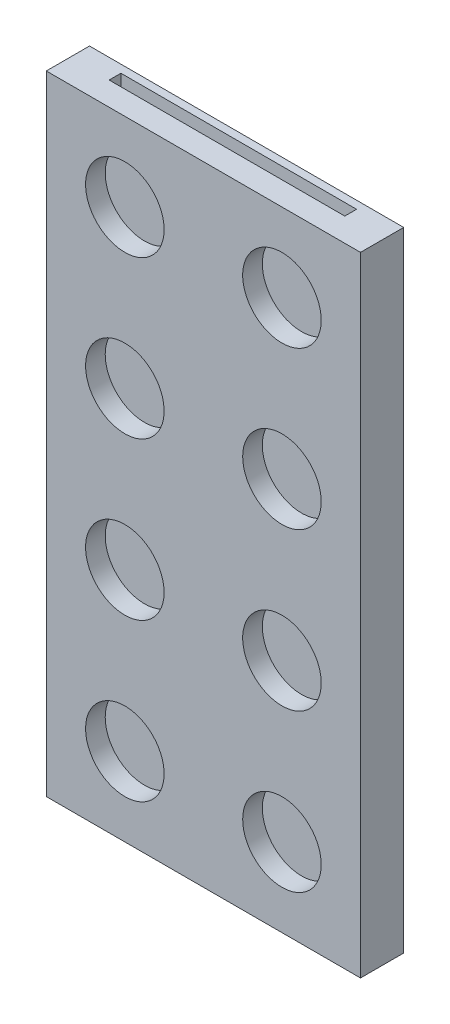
ISO-10303-21;
HEADER;
FILE_DESCRIPTION(('STEP AP214'),'2;1');
FILE_NAME('part.step','',(''),(''),'','','');
FILE_SCHEMA(('AUTOMOTIVE_DESIGN { 1 0 10303 214 1 1 1 1 }'));
ENDSEC;
DATA;
#1=APPLICATION_CONTEXT('core data for automotive mechanical design processes');
#2=APPLICATION_PROTOCOL_DEFINITION('international standard','automotive_design',2000,#1);
#3=PRODUCT_CONTEXT('',#1,'mechanical');
#4=PRODUCT('Part','Part','',(#3));
#5=PRODUCT_RELATED_PRODUCT_CATEGORY('part','',(#4));
#6=PRODUCT_DEFINITION_FORMATION('','',#4);
#7=PRODUCT_DEFINITION_CONTEXT('part definition',#1,'design');
#8=PRODUCT_DEFINITION('design','',#6,#7);
#9=PRODUCT_DEFINITION_SHAPE('','',#8);
#10=(LENGTH_UNIT() NAMED_UNIT(*) SI_UNIT(.MILLI.,.METRE.));
#11=(NAMED_UNIT(*) PLANE_ANGLE_UNIT() SI_UNIT($,.RADIAN.));
#12=(NAMED_UNIT(*) SI_UNIT($,.STERADIAN.) SOLID_ANGLE_UNIT());
#13=UNCERTAINTY_MEASURE_WITH_UNIT(LENGTH_MEASURE(1.E-05),#10,'distance_accuracy_value','');
#14=(GEOMETRIC_REPRESENTATION_CONTEXT(3) GLOBAL_UNCERTAINTY_ASSIGNED_CONTEXT((#13)) GLOBAL_UNIT_ASSIGNED_CONTEXT((#10,
#11,#12)) REPRESENTATION_CONTEXT('',''));
#15=CARTESIAN_POINT('',(0.,0.,0.));
#16=DIRECTION('',(0.,0.,1.));
#17=DIRECTION('',(1.,0.,0.));
#18=AXIS2_PLACEMENT_3D('',#15,#16,#17);
#19=CARTESIAN_POINT('',(0.,0.,6.985));
#20=DIRECTION('',(0.,0.,-1.));
#21=DIRECTION('',(-1.,0.,0.));
#22=AXIS2_PLACEMENT_3D('',#19,#20,#21);
#23=PLANE('',#22);
#24=CARTESIAN_POINT('',(12.7,63.5,6.985));
#25=DIRECTION('',(0.,0.,-1.));
#26=DIRECTION('',(-1.,0.,0.));
#27=AXIS2_PLACEMENT_3D('',#24,#25,#26);
#28=CIRCLE('',#27,6.35);
#29=CARTESIAN_POINT('',(6.35,63.5,6.985));
#30=VERTEX_POINT('',#29);
#31=EDGE_CURVE('E263',#30,#30,#28,.T.);
#32=ORIENTED_EDGE('',*,*,#31,.T.);
#33=EDGE_LOOP('',(#32));
#34=FACE_BOUND('',#33,.T.);
#35=CARTESIAN_POINT('',(12.7,38.1,6.985));
#36=DIRECTION('',(0.,0.,1.));
#37=DIRECTION('',(1.,0.,0.));
#38=AXIS2_PLACEMENT_3D('',#35,#36,#37);
#39=CIRCLE('',#38,6.35);
#40=CARTESIAN_POINT('',(19.05,38.1,6.985));
#41=VERTEX_POINT('',#40);
#42=EDGE_CURVE('E247',#41,#41,#39,.T.);
#43=ORIENTED_EDGE('',*,*,#42,.F.);
#44=EDGE_LOOP('',(#43));
#45=FACE_BOUND('',#44,.T.);
#46=CARTESIAN_POINT('',(38.1,63.5,6.985));
#47=DIRECTION('',(0.,0.,-1.));
#48=DIRECTION('',(-1.,0.,0.));
#49=AXIS2_PLACEMENT_3D('',#46,#47,#48);
#50=CIRCLE('',#49,6.35);
#51=CARTESIAN_POINT('',(31.75,63.5,6.985));
#52=VERTEX_POINT('',#51);
#53=EDGE_CURVE('E255',#52,#52,#50,.T.);
#54=ORIENTED_EDGE('',*,*,#53,.T.);
#55=EDGE_LOOP('',(#54));
#56=FACE_BOUND('',#55,.T.);
#57=CARTESIAN_POINT('',(38.1,38.1,6.985));
#58=DIRECTION('',(0.,0.,1.));
#59=DIRECTION('',(1.,0.,0.));
#60=AXIS2_PLACEMENT_3D('',#57,#58,#59);
#61=CIRCLE('',#60,6.35);
#62=CARTESIAN_POINT('',(44.45,38.1,6.985));
#63=VERTEX_POINT('',#62);
#64=EDGE_CURVE('E239',#63,#63,#61,.T.);
#65=ORIENTED_EDGE('',*,*,#64,.F.);
#66=EDGE_LOOP('',(#65));
#67=FACE_BOUND('',#66,.T.);
#68=CARTESIAN_POINT('',(12.7,12.7,6.985));
#69=DIRECTION('',(0.,0.,-1.));
#70=DIRECTION('',(-1.,0.,0.));
#71=AXIS2_PLACEMENT_3D('',#68,#69,#70);
#72=CIRCLE('',#71,6.35);
#73=CARTESIAN_POINT('',(6.35,12.7,6.985));
#74=VERTEX_POINT('',#73);
#75=EDGE_CURVE('E231',#74,#74,#72,.T.);
#76=ORIENTED_EDGE('',*,*,#75,.T.);
#77=EDGE_LOOP('',(#76));
#78=FACE_BOUND('',#77,.T.);
#79=DIRECTION('',(0.,-1.,0.));
#80=VECTOR('',#79,1.);
#81=CARTESIAN_POINT('',(0.,0.,6.985));
#82=LINE('',#81,#80);
#83=CARTESIAN_POINT('',(0.,101.6,6.985));
#84=VERTEX_POINT('',#83);
#85=CARTESIAN_POINT('',(0.,0.,6.985));
#86=VERTEX_POINT('',#85);
#87=EDGE_CURVE('E287',#84,#86,#82,.T.);
#88=ORIENTED_EDGE('',*,*,#87,.T.);
#89=DIRECTION('',(1.,0.,0.));
#90=VECTOR('',#89,1.);
#91=CARTESIAN_POINT('',(0.,0.,6.985));
#92=LINE('',#91,#90);
#93=CARTESIAN_POINT('',(50.8,0.,6.985));
#94=VERTEX_POINT('',#93);
#95=EDGE_CURVE('E291',#86,#94,#92,.T.);
#96=ORIENTED_EDGE('',*,*,#95,.T.);
#97=DIRECTION('',(0.,1.,0.));
#98=VECTOR('',#97,1.);
#99=CARTESIAN_POINT('',(50.8,0.,6.985));
#100=LINE('',#99,#98);
#101=CARTESIAN_POINT('',(50.8,101.6,6.985));
#102=VERTEX_POINT('',#101);
#103=EDGE_CURVE('E295',#94,#102,#100,.T.);
#104=ORIENTED_EDGE('',*,*,#103,.T.);
#105=DIRECTION('',(-1.,0.,0.));
#106=VECTOR('',#105,1.);
#107=CARTESIAN_POINT('',(0.,101.6,6.985));
#108=LINE('',#107,#106);
#109=EDGE_CURVE('E298',#102,#84,#108,.T.);
#110=ORIENTED_EDGE('',*,*,#109,.T.);
#111=EDGE_LOOP('',(#88,#96,#104,#110));
#112=FACE_BOUND('',#111,.T.);
#113=CARTESIAN_POINT('',(38.1,12.7,6.985));
#114=DIRECTION('',(0.,0.,-1.));
#115=DIRECTION('',(-1.,0.,0.));
#116=AXIS2_PLACEMENT_3D('',#113,#114,#115);
#117=CIRCLE('',#116,6.35);
#118=CARTESIAN_POINT('',(31.75,12.7,6.985));
#119=VERTEX_POINT('',#118);
#120=EDGE_CURVE('E223',#119,#119,#117,.T.);
#121=ORIENTED_EDGE('',*,*,#120,.T.);
#122=EDGE_LOOP('',(#121));
#123=FACE_BOUND('',#122,.T.);
#124=CARTESIAN_POINT('',(12.7,88.9,6.985));
#125=DIRECTION('',(0.,0.,1.));
#126=DIRECTION('',(1.,0.,0.));
#127=AXIS2_PLACEMENT_3D('',#124,#125,#126);
#128=CIRCLE('',#127,6.35);
#129=CARTESIAN_POINT('',(19.05,88.9,6.985));
#130=VERTEX_POINT('',#129);
#131=EDGE_CURVE('E279',#130,#130,#128,.T.);
#132=ORIENTED_EDGE('',*,*,#131,.F.);
#133=EDGE_LOOP('',(#132));
#134=FACE_BOUND('',#133,.T.);
#135=CARTESIAN_POINT('',(38.1,88.9,6.985));
#136=DIRECTION('',(0.,0.,1.));
#137=DIRECTION('',(1.,0.,0.));
#138=AXIS2_PLACEMENT_3D('',#135,#136,#137);
#139=CIRCLE('',#138,6.35);
#140=CARTESIAN_POINT('',(44.45,88.9,6.985));
#141=VERTEX_POINT('',#140);
#142=EDGE_CURVE('E271',#141,#141,#139,.T.);
#143=ORIENTED_EDGE('',*,*,#142,.F.);
#144=EDGE_LOOP('',(#143));
#145=FACE_BOUND('',#144,.T.);
#146=ADVANCED_FACE('F45',(#34,#45,#56,#67,#78,#112,#123,#134,#145),#23,.F.);
#147=CARTESIAN_POINT('',(0.,0.,6.985));
#148=DIRECTION('',(1.,0.,0.));
#149=DIRECTION('',(0.,0.,-1.));
#150=AXIS2_PLACEMENT_3D('',#147,#148,#149);
#151=PLANE('',#150);
#152=DIRECTION('',(0.,-1.,0.));
#153=VECTOR('',#152,1.);
#154=CARTESIAN_POINT('',(0.,0.,0.));
#155=LINE('',#154,#153);
#156=CARTESIAN_POINT('',(0.,101.6,0.));
#157=VERTEX_POINT('',#156);
#158=CARTESIAN_POINT('',(0.,0.,0.));
#159=VERTEX_POINT('',#158);
#160=EDGE_CURVE('E283',#157,#159,#155,.T.);
#161=ORIENTED_EDGE('',*,*,#160,.T.);
#162=DIRECTION('',(0.,0.,-1.));
#163=VECTOR('',#162,1.);
#164=CARTESIAN_POINT('',(0.,0.,6.985));
#165=LINE('',#164,#163);
#166=EDGE_CURVE('E54',#86,#159,#165,.T.);
#167=ORIENTED_EDGE('',*,*,#166,.F.);
#168=ORIENTED_EDGE('',*,*,#87,.F.);
#169=DIRECTION('',(0.,0.,-1.));
#170=VECTOR('',#169,1.);
#171=CARTESIAN_POINT('',(0.,101.6,6.985));
#172=LINE('',#171,#170);
#173=EDGE_CURVE('E301',#84,#157,#172,.T.);
#174=ORIENTED_EDGE('',*,*,#173,.T.);
#175=EDGE_LOOP('',(#161,#167,#168,#174));
#176=FACE_BOUND('',#175,.T.);
#177=ADVANCED_FACE('F47',(#176),#151,.F.);
#178=CARTESIAN_POINT('',(0.,0.,6.985));
#179=DIRECTION('',(0.,1.,0.));
#180=DIRECTION('',(0.,0.,1.));
#181=AXIS2_PLACEMENT_3D('',#178,#179,#180);
#182=PLANE('',#181);
#183=DIRECTION('',(1.,0.,0.));
#184=VECTOR('',#183,1.);
#185=CARTESIAN_POINT('',(0.,0.,0.));
#186=LINE('',#185,#184);
#187=CARTESIAN_POINT('',(50.8,0.,0.));
#188=VERTEX_POINT('',#187);
#189=EDGE_CURVE('E305',#159,#188,#186,.T.);
#190=ORIENTED_EDGE('',*,*,#189,.T.);
#191=DIRECTION('',(0.,0.,-1.));
#192=VECTOR('',#191,1.);
#193=CARTESIAN_POINT('',(50.8,0.,6.985));
#194=LINE('',#193,#192);
#195=EDGE_CURVE('E320',#94,#188,#194,.T.);
#196=ORIENTED_EDGE('',*,*,#195,.F.);
#197=ORIENTED_EDGE('',*,*,#95,.F.);
#198=ORIENTED_EDGE('',*,*,#166,.T.);
#199=EDGE_LOOP('',(#190,#196,#197,#198));
#200=FACE_BOUND('',#199,.T.);
#201=ADVANCED_FACE('F327',(#200),#182,.F.);
#202=CARTESIAN_POINT('',(50.8,0.,6.985));
#203=DIRECTION('',(-1.,0.,0.));
#204=DIRECTION('',(0.,0.,1.));
#205=AXIS2_PLACEMENT_3D('',#202,#203,#204);
#206=PLANE('',#205);
#207=DIRECTION('',(0.,1.,0.));
#208=VECTOR('',#207,1.);
#209=CARTESIAN_POINT('',(50.8,0.,0.));
#210=LINE('',#209,#208);
#211=CARTESIAN_POINT('',(50.8,101.6,0.));
#212=VERTEX_POINT('',#211);
#213=EDGE_CURVE('E308',#188,#212,#210,.T.);
#214=ORIENTED_EDGE('',*,*,#213,.T.);
#215=DIRECTION('',(0.,0.,-1.));
#216=VECTOR('',#215,1.);
#217=CARTESIAN_POINT('',(50.8,101.6,6.985));
#218=LINE('',#217,#216);
#219=EDGE_CURVE('E316',#102,#212,#218,.T.);
#220=ORIENTED_EDGE('',*,*,#219,.F.);
#221=ORIENTED_EDGE('',*,*,#103,.F.);
#222=ORIENTED_EDGE('',*,*,#195,.T.);
#223=EDGE_LOOP('',(#214,#220,#221,#222));
#224=FACE_BOUND('',#223,.T.);
#225=ADVANCED_FACE('F339',(#224),#206,.F.);
#226=CARTESIAN_POINT('',(0.,101.6,6.985));
#227=DIRECTION('',(0.,-1.,0.));
#228=DIRECTION('',(0.,0.,-1.));
#229=AXIS2_PLACEMENT_3D('',#226,#227,#228);
#230=PLANE('',#229);
#231=DIRECTION('',(1.,0.,0.));
#232=VECTOR('',#231,1.);
#233=CARTESIAN_POINT('',(44.45,101.6,3.17499999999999));
#234=LINE('',#233,#232);
#235=CARTESIAN_POINT('',(6.35,101.6,3.175));
#236=VERTEX_POINT('',#235);
#237=CARTESIAN_POINT('',(44.45,101.6,3.17499999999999));
#238=VERTEX_POINT('',#237);
#239=EDGE_CURVE('E170',#236,#238,#234,.T.);
#240=ORIENTED_EDGE('',*,*,#239,.F.);
#241=DIRECTION('',(0.,0.,1.));
#242=VECTOR('',#241,1.);
#243=CARTESIAN_POINT('',(6.35,101.6,3.175));
#244=LINE('',#243,#242);
#245=CARTESIAN_POINT('',(6.35,101.6,1.27));
#246=VERTEX_POINT('',#245);
#247=EDGE_CURVE('E61',#246,#236,#244,.T.);
#248=ORIENTED_EDGE('',*,*,#247,.F.);
#249=DIRECTION('',(-1.,0.,0.));
#250=VECTOR('',#249,1.);
#251=CARTESIAN_POINT('',(6.35,101.6,1.27));
#252=LINE('',#251,#250);
#253=CARTESIAN_POINT('',(44.45,101.6,1.27));
#254=VERTEX_POINT('',#253);
#255=EDGE_CURVE('E157',#254,#246,#252,.T.);
#256=ORIENTED_EDGE('',*,*,#255,.F.);
#257=DIRECTION('',(0.,0.,-1.));
#258=VECTOR('',#257,1.);
#259=CARTESIAN_POINT('',(44.45,101.6,1.27));
#260=LINE('',#259,#258);
#261=EDGE_CURVE('E161',#238,#254,#260,.T.);
#262=ORIENTED_EDGE('',*,*,#261,.F.);
#263=EDGE_LOOP('',(#240,#248,#256,#262));
#264=FACE_BOUND('',#263,.T.);
#265=DIRECTION('',(-1.,0.,0.));
#266=VECTOR('',#265,1.);
#267=CARTESIAN_POINT('',(0.,101.6,0.));
#268=LINE('',#267,#266);
#269=EDGE_CURVE('E292',#212,#157,#268,.T.);
#270=ORIENTED_EDGE('',*,*,#269,.T.);
#271=ORIENTED_EDGE('',*,*,#173,.F.);
#272=ORIENTED_EDGE('',*,*,#109,.F.);
#273=ORIENTED_EDGE('',*,*,#219,.T.);
#274=EDGE_LOOP('',(#270,#271,#272,#273));
#275=FACE_BOUND('',#274,.T.);
#276=ADVANCED_FACE('F343',(#264,#275),#230,.F.);
#277=CARTESIAN_POINT('',(0.,0.,0.));
#278=DIRECTION('',(0.,0.,-1.));
#279=DIRECTION('',(-1.,0.,0.));
#280=AXIS2_PLACEMENT_3D('',#277,#278,#279);
#281=PLANE('',#280);
#282=DIRECTION('',(0.,-1.,0.));
#283=VECTOR('',#282,1.);
#284=CARTESIAN_POINT('',(43.18,7.61999999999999,0.));
#285=LINE('',#284,#283);
#286=CARTESIAN_POINT('',(43.18,93.98,0.));
#287=VERTEX_POINT('',#286);
#288=CARTESIAN_POINT('',(43.18,7.61999999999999,0.));
#289=VERTEX_POINT('',#288);
#290=EDGE_CURVE('E194',#287,#289,#285,.T.);
#291=ORIENTED_EDGE('',*,*,#290,.F.);
#292=DIRECTION('',(1.,0.,0.));
#293=VECTOR('',#292,1.);
#294=CARTESIAN_POINT('',(43.18,93.98,0.));
#295=LINE('',#294,#293);
#296=CARTESIAN_POINT('',(7.62,93.98,0.));
#297=VERTEX_POINT('',#296);
#298=EDGE_CURVE('E206',#297,#287,#295,.T.);
#299=ORIENTED_EDGE('',*,*,#298,.F.);
#300=DIRECTION('',(0.,1.,0.));
#301=VECTOR('',#300,1.);
#302=CARTESIAN_POINT('',(7.62,93.98,0.));
#303=LINE('',#302,#301);
#304=CARTESIAN_POINT('',(7.61999999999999,7.62,0.));
#305=VERTEX_POINT('',#304);
#306=EDGE_CURVE('E202',#305,#297,#303,.T.);
#307=ORIENTED_EDGE('',*,*,#306,.F.);
#308=DIRECTION('',(-1.,0.,0.));
#309=VECTOR('',#308,1.);
#310=CARTESIAN_POINT('',(7.61999999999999,7.62,0.));
#311=LINE('',#310,#309);
#312=EDGE_CURVE('E198',#289,#305,#311,.T.);
#313=ORIENTED_EDGE('',*,*,#312,.F.);
#314=EDGE_LOOP('',(#291,#299,#307,#313));
#315=FACE_BOUND('',#314,.T.);
#316=ORIENTED_EDGE('',*,*,#160,.F.);
#317=ORIENTED_EDGE('',*,*,#269,.F.);
#318=ORIENTED_EDGE('',*,*,#213,.F.);
#319=ORIENTED_EDGE('',*,*,#189,.F.);
#320=EDGE_LOOP('',(#316,#317,#318,#319));
#321=FACE_BOUND('',#320,.T.);
#322=ADVANCED_FACE('F335',(#315,#321),#281,.T.);
#323=CARTESIAN_POINT('',(12.7,12.7,3.81));
#324=DIRECTION('',(0.,0.,1.));
#325=DIRECTION('',(1.,0.,0.));
#326=AXIS2_PLACEMENT_3D('',#323,#324,#325);
#327=CYLINDRICAL_SURFACE('',#326,6.35);
#328=CARTESIAN_POINT('',(12.7,12.7,3.81));
#329=DIRECTION('',(0.,0.,-1.));
#330=DIRECTION('',(-1.,0.,0.));
#331=AXIS2_PLACEMENT_3D('',#328,#329,#330);
#332=CIRCLE('',#331,6.35);
#333=CARTESIAN_POINT('',(6.35,12.7,3.81));
#334=VERTEX_POINT('',#333);
#335=EDGE_CURVE('E227',#334,#334,#332,.T.);
#336=ORIENTED_EDGE('',*,*,#335,.T.);
#337=EDGE_LOOP('',(#336));
#338=FACE_BOUND('',#337,.T.);
#339=ORIENTED_EDGE('',*,*,#75,.F.);
#340=EDGE_LOOP('',(#339));
#341=FACE_BOUND('',#340,.T.);
#342=ADVANCED_FACE('F388',(#338,#341),#327,.F.);
#343=CARTESIAN_POINT('',(12.7,12.7,3.81));
#344=DIRECTION('',(0.,0.,-1.));
#345=DIRECTION('',(-1.,0.,0.));
#346=AXIS2_PLACEMENT_3D('',#343,#344,#345);
#347=PLANE('',#346);
#348=ORIENTED_EDGE('',*,*,#335,.F.);
#349=EDGE_LOOP('',(#348));
#350=FACE_BOUND('',#349,.T.);
#351=ADVANCED_FACE('F440',(#350),#347,.F.);
#352=CARTESIAN_POINT('',(38.1,38.1,3.81));
#353=DIRECTION('',(0.,0.,1.));
#354=DIRECTION('',(1.,0.,0.));
#355=AXIS2_PLACEMENT_3D('',#352,#353,#354);
#356=CYLINDRICAL_SURFACE('',#355,6.35);
#357=CARTESIAN_POINT('',(38.1,38.1,3.81));
#358=DIRECTION('',(0.,0.,1.));
#359=DIRECTION('',(1.,0.,0.));
#360=AXIS2_PLACEMENT_3D('',#357,#358,#359);
#361=CIRCLE('',#360,6.35);
#362=CARTESIAN_POINT('',(44.45,38.1,3.81));
#363=VERTEX_POINT('',#362);
#364=EDGE_CURVE('E235',#363,#363,#361,.T.);
#365=ORIENTED_EDGE('',*,*,#364,.F.);
#366=EDGE_LOOP('',(#365));
#367=FACE_BOUND('',#366,.T.);
#368=ORIENTED_EDGE('',*,*,#64,.T.);
#369=EDGE_LOOP('',(#368));
#370=FACE_BOUND('',#369,.T.);
#371=ADVANCED_FACE('F450',(#367,#370),#356,.F.);
#372=CARTESIAN_POINT('',(38.1,38.1,3.81));
#373=DIRECTION('',(0.,0.,1.));
#374=DIRECTION('',(1.,0.,0.));
#375=AXIS2_PLACEMENT_3D('',#372,#373,#374);
#376=PLANE('',#375);
#377=ORIENTED_EDGE('',*,*,#364,.T.);
#378=EDGE_LOOP('',(#377));
#379=FACE_BOUND('',#378,.T.);
#380=ADVANCED_FACE('F460',(#379),#376,.T.);
#381=CARTESIAN_POINT('',(38.1,12.7,3.81));
#382=DIRECTION('',(0.,0.,1.));
#383=DIRECTION('',(1.,0.,0.));
#384=AXIS2_PLACEMENT_3D('',#381,#382,#383);
#385=CYLINDRICAL_SURFACE('',#384,6.35);
#386=CARTESIAN_POINT('',(38.1,12.7,3.81));
#387=DIRECTION('',(0.,0.,-1.));
#388=DIRECTION('',(-1.,0.,0.));
#389=AXIS2_PLACEMENT_3D('',#386,#387,#388);
#390=CIRCLE('',#389,6.35);
#391=CARTESIAN_POINT('',(31.75,12.7,3.81));
#392=VERTEX_POINT('',#391);
#393=EDGE_CURVE('E214',#392,#392,#390,.T.);
#394=ORIENTED_EDGE('',*,*,#393,.T.);
#395=EDGE_LOOP('',(#394));
#396=FACE_BOUND('',#395,.T.);
#397=ORIENTED_EDGE('',*,*,#120,.F.);
#398=EDGE_LOOP('',(#397));
#399=FACE_BOUND('',#398,.T.);
#400=ADVANCED_FACE('F470',(#396,#399),#385,.F.);
#401=CARTESIAN_POINT('',(38.1,12.7,3.81));
#402=DIRECTION('',(0.,0.,-1.));
#403=DIRECTION('',(-1.,0.,0.));
#404=AXIS2_PLACEMENT_3D('',#401,#402,#403);
#405=PLANE('',#404);
#406=ORIENTED_EDGE('',*,*,#393,.F.);
#407=EDGE_LOOP('',(#406));
#408=FACE_BOUND('',#407,.T.);
#409=ADVANCED_FACE('F380',(#408),#405,.F.);
#410=CARTESIAN_POINT('',(12.7,88.9,3.81));
#411=DIRECTION('',(0.,0.,1.));
#412=DIRECTION('',(1.,0.,0.));
#413=AXIS2_PLACEMENT_3D('',#410,#411,#412);
#414=CYLINDRICAL_SURFACE('',#413,6.35);
#415=CARTESIAN_POINT('',(12.7,88.9,3.81));
#416=DIRECTION('',(0.,0.,1.));
#417=DIRECTION('',(1.,0.,0.));
#418=AXIS2_PLACEMENT_3D('',#415,#416,#417);
#419=CIRCLE('',#418,6.35);
#420=CARTESIAN_POINT('',(19.05,88.9,3.81));
#421=VERTEX_POINT('',#420);
#422=EDGE_CURVE('E275',#421,#421,#419,.T.);
#423=ORIENTED_EDGE('',*,*,#422,.F.);
#424=EDGE_LOOP('',(#423));
#425=FACE_BOUND('',#424,.T.);
#426=ORIENTED_EDGE('',*,*,#131,.T.);
#427=EDGE_LOOP('',(#426));
#428=FACE_BOUND('',#427,.T.);
#429=ADVANCED_FACE('F376',(#425,#428),#414,.F.);
#430=CARTESIAN_POINT('',(12.7,88.9,3.81));
#431=DIRECTION('',(0.,0.,1.));
#432=DIRECTION('',(1.,0.,0.));
#433=AXIS2_PLACEMENT_3D('',#430,#431,#432);
#434=PLANE('',#433);
#435=ORIENTED_EDGE('',*,*,#422,.T.);
#436=EDGE_LOOP('',(#435));
#437=FACE_BOUND('',#436,.T.);
#438=ADVANCED_FACE('F379',(#437),#434,.T.);
#439=CARTESIAN_POINT('',(38.1,63.5,3.81));
#440=DIRECTION('',(0.,0.,1.));
#441=DIRECTION('',(1.,0.,0.));
#442=AXIS2_PLACEMENT_3D('',#439,#440,#441);
#443=CYLINDRICAL_SURFACE('',#442,6.35);
#444=CARTESIAN_POINT('',(38.1,63.5,3.81));
#445=DIRECTION('',(0.,0.,-1.));
#446=DIRECTION('',(-1.,0.,0.));
#447=AXIS2_PLACEMENT_3D('',#444,#445,#446);
#448=CIRCLE('',#447,6.35);
#449=CARTESIAN_POINT('',(31.75,63.5,3.81));
#450=VERTEX_POINT('',#449);
#451=EDGE_CURVE('E251',#450,#450,#448,.T.);
#452=ORIENTED_EDGE('',*,*,#451,.T.);
#453=EDGE_LOOP('',(#452));
#454=FACE_BOUND('',#453,.T.);
#455=ORIENTED_EDGE('',*,*,#53,.F.);
#456=EDGE_LOOP('',(#455));
#457=FACE_BOUND('',#456,.T.);
#458=ADVANCED_FACE('F383',(#454,#457),#443,.F.);
#459=CARTESIAN_POINT('',(38.1,63.5,3.81));
#460=DIRECTION('',(0.,0.,-1.));
#461=DIRECTION('',(-1.,0.,0.));
#462=AXIS2_PLACEMENT_3D('',#459,#460,#461);
#463=PLANE('',#462);
#464=ORIENTED_EDGE('',*,*,#451,.F.);
#465=EDGE_LOOP('',(#464));
#466=FACE_BOUND('',#465,.T.);
#467=ADVANCED_FACE('F510',(#466),#463,.F.);
#468=CARTESIAN_POINT('',(12.7,38.1,3.81));
#469=DIRECTION('',(0.,0.,1.));
#470=DIRECTION('',(1.,0.,0.));
#471=AXIS2_PLACEMENT_3D('',#468,#469,#470);
#472=CYLINDRICAL_SURFACE('',#471,6.35);
#473=CARTESIAN_POINT('',(12.7,38.1,3.81));
#474=DIRECTION('',(0.,0.,1.));
#475=DIRECTION('',(1.,0.,0.));
#476=AXIS2_PLACEMENT_3D('',#473,#474,#475);
#477=CIRCLE('',#476,6.35);
#478=CARTESIAN_POINT('',(19.05,38.1,3.81));
#479=VERTEX_POINT('',#478);
#480=EDGE_CURVE('E243',#479,#479,#477,.T.);
#481=ORIENTED_EDGE('',*,*,#480,.F.);
#482=EDGE_LOOP('',(#481));
#483=FACE_BOUND('',#482,.T.);
#484=ORIENTED_EDGE('',*,*,#42,.T.);
#485=EDGE_LOOP('',(#484));
#486=FACE_BOUND('',#485,.T.);
#487=ADVANCED_FACE('F368',(#483,#486),#472,.F.);
#488=CARTESIAN_POINT('',(12.7,38.1,3.81));
#489=DIRECTION('',(0.,0.,1.));
#490=DIRECTION('',(1.,0.,0.));
#491=AXIS2_PLACEMENT_3D('',#488,#489,#490);
#492=PLANE('',#491);
#493=ORIENTED_EDGE('',*,*,#480,.T.);
#494=EDGE_LOOP('',(#493));
#495=FACE_BOUND('',#494,.T.);
#496=ADVANCED_FACE('F358',(#495),#492,.T.);
#497=CARTESIAN_POINT('',(38.1,88.9,3.81));
#498=DIRECTION('',(0.,0.,1.));
#499=DIRECTION('',(1.,0.,0.));
#500=AXIS2_PLACEMENT_3D('',#497,#498,#499);
#501=CYLINDRICAL_SURFACE('',#500,6.35);
#502=CARTESIAN_POINT('',(38.1,88.9,3.81));
#503=DIRECTION('',(0.,0.,1.));
#504=DIRECTION('',(1.,0.,0.));
#505=AXIS2_PLACEMENT_3D('',#502,#503,#504);
#506=CIRCLE('',#505,6.35);
#507=CARTESIAN_POINT('',(44.45,88.9,3.81));
#508=VERTEX_POINT('',#507);
#509=EDGE_CURVE('E267',#508,#508,#506,.T.);
#510=ORIENTED_EDGE('',*,*,#509,.F.);
#511=EDGE_LOOP('',(#510));
#512=FACE_BOUND('',#511,.T.);
#513=ORIENTED_EDGE('',*,*,#142,.T.);
#514=EDGE_LOOP('',(#513));
#515=FACE_BOUND('',#514,.T.);
#516=ADVANCED_FACE('F355',(#512,#515),#501,.F.);
#517=CARTESIAN_POINT('',(38.1,88.9,3.81));
#518=DIRECTION('',(0.,0.,1.));
#519=DIRECTION('',(1.,0.,0.));
#520=AXIS2_PLACEMENT_3D('',#517,#518,#519);
#521=PLANE('',#520);
#522=ORIENTED_EDGE('',*,*,#509,.T.);
#523=EDGE_LOOP('',(#522));
#524=FACE_BOUND('',#523,.T.);
#525=ADVANCED_FACE('F357',(#524),#521,.T.);
#526=CARTESIAN_POINT('',(12.7,63.5,3.81));
#527=DIRECTION('',(0.,0.,1.));
#528=DIRECTION('',(1.,0.,0.));
#529=AXIS2_PLACEMENT_3D('',#526,#527,#528);
#530=CYLINDRICAL_SURFACE('',#529,6.35);
#531=CARTESIAN_POINT('',(12.7,63.5,3.81));
#532=DIRECTION('',(0.,0.,-1.));
#533=DIRECTION('',(-1.,0.,0.));
#534=AXIS2_PLACEMENT_3D('',#531,#532,#533);
#535=CIRCLE('',#534,6.35);
#536=CARTESIAN_POINT('',(6.35,63.5,3.81));
#537=VERTEX_POINT('',#536);
#538=EDGE_CURVE('E259',#537,#537,#535,.T.);
#539=ORIENTED_EDGE('',*,*,#538,.T.);
#540=EDGE_LOOP('',(#539));
#541=FACE_BOUND('',#540,.T.);
#542=ORIENTED_EDGE('',*,*,#31,.F.);
#543=EDGE_LOOP('',(#542));
#544=FACE_BOUND('',#543,.T.);
#545=ADVANCED_FACE('F365',(#541,#544),#530,.F.);
#546=CARTESIAN_POINT('',(12.7,63.5,3.81));
#547=DIRECTION('',(0.,0.,-1.));
#548=DIRECTION('',(-1.,0.,0.));
#549=AXIS2_PLACEMENT_3D('',#546,#547,#548);
#550=PLANE('',#549);
#551=ORIENTED_EDGE('',*,*,#538,.F.);
#552=EDGE_LOOP('',(#551));
#553=FACE_BOUND('',#552,.T.);
#554=ADVANCED_FACE('F373',(#553),#550,.F.);
#555=CARTESIAN_POINT('',(43.18,7.61999999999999,2.54));
#556=DIRECTION('',(1.,0.,0.));
#557=DIRECTION('',(0.,0.,-1.));
#558=AXIS2_PLACEMENT_3D('',#555,#556,#557);
#559=PLANE('',#558);
#560=DIRECTION('',(0.,0.,-1.));
#561=VECTOR('',#560,1.);
#562=CARTESIAN_POINT('',(43.18,7.61999999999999,2.54));
#563=LINE('',#562,#561);
#564=CARTESIAN_POINT('',(43.18,7.61999999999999,1.27));
#565=VERTEX_POINT('',#564);
#566=EDGE_CURVE('E210',#565,#289,#563,.T.);
#567=ORIENTED_EDGE('',*,*,#566,.F.);
#568=DIRECTION('',(0.,1.,0.));
#569=VECTOR('',#568,1.);
#570=CARTESIAN_POINT('',(43.18,7.61999999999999,1.27));
#571=LINE('',#570,#569);
#572=CARTESIAN_POINT('',(43.18,93.98,1.27));
#573=VERTEX_POINT('',#572);
#574=EDGE_CURVE('E69',#565,#573,#571,.T.);
#575=ORIENTED_EDGE('',*,*,#574,.T.);
#576=DIRECTION('',(0.,0.,-1.));
#577=VECTOR('',#576,1.);
#578=CARTESIAN_POINT('',(43.18,93.98,2.54));
#579=LINE('',#578,#577);
#580=EDGE_CURVE('E211',#573,#287,#579,.T.);
#581=ORIENTED_EDGE('',*,*,#580,.T.);
#582=ORIENTED_EDGE('',*,*,#290,.T.);
#583=EDGE_LOOP('',(#567,#575,#581,#582));
#584=FACE_BOUND('',#583,.T.);
#585=ADVANCED_FACE('F561',(#584),#559,.F.);
#586=CARTESIAN_POINT('',(43.18,93.98,2.54));
#587=DIRECTION('',(0.,1.,0.));
#588=DIRECTION('',(0.,0.,1.));
#589=AXIS2_PLACEMENT_3D('',#586,#587,#588);
#590=PLANE('',#589);
#591=ORIENTED_EDGE('',*,*,#580,.F.);
#592=DIRECTION('',(-1.,0.,0.));
#593=VECTOR('',#592,1.);
#594=CARTESIAN_POINT('',(43.18,93.98,1.27));
#595=LINE('',#594,#593);
#596=CARTESIAN_POINT('',(7.62,93.98,1.27));
#597=VERTEX_POINT('',#596);
#598=EDGE_CURVE('E188',#573,#597,#595,.T.);
#599=ORIENTED_EDGE('',*,*,#598,.T.);
#600=DIRECTION('',(0.,0.,-1.));
#601=VECTOR('',#600,1.);
#602=CARTESIAN_POINT('',(7.62,93.98,2.54));
#603=LINE('',#602,#601);
#604=EDGE_CURVE('E215',#597,#297,#603,.T.);
#605=ORIENTED_EDGE('',*,*,#604,.T.);
#606=ORIENTED_EDGE('',*,*,#298,.T.);
#607=EDGE_LOOP('',(#591,#599,#605,#606));
#608=FACE_BOUND('',#607,.T.);
#609=ADVANCED_FACE('F569',(#608),#590,.F.);
#610=CARTESIAN_POINT('',(7.62,93.98,2.54));
#611=DIRECTION('',(-1.,0.,0.));
#612=DIRECTION('',(0.,-1.,0.));
#613=AXIS2_PLACEMENT_3D('',#610,#611,#612);
#614=PLANE('',#613);
#615=ORIENTED_EDGE('',*,*,#604,.F.);
#616=DIRECTION('',(0.,-1.,0.));
#617=VECTOR('',#616,1.);
#618=CARTESIAN_POINT('',(7.62,93.98,1.27));
#619=LINE('',#618,#617);
#620=CARTESIAN_POINT('',(7.61999999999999,7.62,1.27));
#621=VERTEX_POINT('',#620);
#622=EDGE_CURVE('E179',#597,#621,#619,.T.);
#623=ORIENTED_EDGE('',*,*,#622,.T.);
#624=DIRECTION('',(0.,0.,-1.));
#625=VECTOR('',#624,1.);
#626=CARTESIAN_POINT('',(7.61999999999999,7.62,2.54));
#627=LINE('',#626,#625);
#628=EDGE_CURVE('E218',#621,#305,#627,.T.);
#629=ORIENTED_EDGE('',*,*,#628,.T.);
#630=ORIENTED_EDGE('',*,*,#306,.T.);
#631=EDGE_LOOP('',(#615,#623,#629,#630));
#632=FACE_BOUND('',#631,.T.);
#633=ADVANCED_FACE('F579',(#632),#614,.F.);
#634=CARTESIAN_POINT('',(7.61999999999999,7.62,2.54));
#635=DIRECTION('',(0.,-1.,0.));
#636=DIRECTION('',(1.,0.,0.));
#637=AXIS2_PLACEMENT_3D('',#634,#635,#636);
#638=PLANE('',#637);
#639=ORIENTED_EDGE('',*,*,#628,.F.);
#640=DIRECTION('',(1.,0.,0.));
#641=VECTOR('',#640,1.);
#642=CARTESIAN_POINT('',(7.61999999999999,7.62,1.27));
#643=LINE('',#642,#641);
#644=EDGE_CURVE('E11',#621,#565,#643,.T.);
#645=ORIENTED_EDGE('',*,*,#644,.T.);
#646=ORIENTED_EDGE('',*,*,#566,.T.);
#647=ORIENTED_EDGE('',*,*,#312,.T.);
#648=EDGE_LOOP('',(#639,#645,#646,#647));
#649=FACE_BOUND('',#648,.T.);
#650=ADVANCED_FACE('F589',(#649),#638,.F.);
#651=CARTESIAN_POINT('',(6.35,6.34999999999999,1.27));
#652=DIRECTION('',(0.,0.,-1.));
#653=DIRECTION('',(-1.,0.,0.));
#654=AXIS2_PLACEMENT_3D('',#651,#652,#653);
#655=PLANE('',#654);
#656=ORIENTED_EDGE('',*,*,#255,.T.);
#657=DIRECTION('',(0.,1.,0.));
#658=VECTOR('',#657,1.);
#659=CARTESIAN_POINT('',(6.35,6.34999999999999,1.27));
#660=LINE('',#659,#658);
#661=CARTESIAN_POINT('',(6.35,6.34999999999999,1.27));
#662=VERTEX_POINT('',#661);
#663=EDGE_CURVE('E176',#662,#246,#660,.T.);
#664=ORIENTED_EDGE('',*,*,#663,.F.);
#665=DIRECTION('',(-1.,0.,0.));
#666=VECTOR('',#665,1.);
#667=CARTESIAN_POINT('',(6.35,6.34999999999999,1.27));
#668=LINE('',#667,#666);
#669=CARTESIAN_POINT('',(44.45,6.34999999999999,1.27));
#670=VERTEX_POINT('',#669);
#671=EDGE_CURVE('E143',#670,#662,#668,.T.);
#672=ORIENTED_EDGE('',*,*,#671,.F.);
#673=DIRECTION('',(0.,1.,0.));
#674=VECTOR('',#673,1.);
#675=CARTESIAN_POINT('',(44.45,6.34999999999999,1.27));
#676=LINE('',#675,#674);
#677=EDGE_CURVE('E180',#670,#254,#676,.T.);
#678=ORIENTED_EDGE('',*,*,#677,.T.);
#679=EDGE_LOOP('',(#656,#664,#672,#678));
#680=FACE_BOUND('',#679,.T.);
#681=ORIENTED_EDGE('',*,*,#644,.F.);
#682=ORIENTED_EDGE('',*,*,#622,.F.);
#683=ORIENTED_EDGE('',*,*,#598,.F.);
#684=ORIENTED_EDGE('',*,*,#574,.F.);
#685=EDGE_LOOP('',(#681,#682,#683,#684));
#686=FACE_BOUND('',#685,.T.);
#687=ADVANCED_FACE('F599',(#680,#686),#655,.F.);
#688=CARTESIAN_POINT('',(6.35,6.34999999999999,3.175));
#689=DIRECTION('',(-1.,0.,0.));
#690=DIRECTION('',(0.,0.,1.));
#691=AXIS2_PLACEMENT_3D('',#688,#689,#690);
#692=PLANE('',#691);
#693=ORIENTED_EDGE('',*,*,#247,.T.);
#694=DIRECTION('',(0.,1.,0.));
#695=VECTOR('',#694,1.);
#696=CARTESIAN_POINT('',(6.35,6.34999999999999,3.175));
#697=LINE('',#696,#695);
#698=CARTESIAN_POINT('',(6.35,6.34999999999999,3.175));
#699=VERTEX_POINT('',#698);
#700=EDGE_CURVE('E132',#699,#236,#697,.T.);
#701=ORIENTED_EDGE('',*,*,#700,.F.);
#702=DIRECTION('',(0.,0.,1.));
#703=VECTOR('',#702,1.);
#704=CARTESIAN_POINT('',(6.35,6.34999999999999,3.175));
#705=LINE('',#704,#703);
#706=EDGE_CURVE('E136',#662,#699,#705,.T.);
#707=ORIENTED_EDGE('',*,*,#706,.F.);
#708=ORIENTED_EDGE('',*,*,#663,.T.);
#709=EDGE_LOOP('',(#693,#701,#707,#708));
#710=FACE_BOUND('',#709,.T.);
#711=ADVANCED_FACE('F134',(#710),#692,.F.);
#712=CARTESIAN_POINT('',(44.45,6.34999999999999,1.27));
#713=DIRECTION('',(1.,0.,0.));
#714=DIRECTION('',(0.,0.,-1.));
#715=AXIS2_PLACEMENT_3D('',#712,#713,#714);
#716=PLANE('',#715);
#717=ORIENTED_EDGE('',*,*,#261,.T.);
#718=ORIENTED_EDGE('',*,*,#677,.F.);
#719=DIRECTION('',(0.,0.,-1.));
#720=VECTOR('',#719,1.);
#721=CARTESIAN_POINT('',(44.45,6.34999999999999,1.27));
#722=LINE('',#721,#720);
#723=CARTESIAN_POINT('',(44.45,6.34999999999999,3.17499999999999));
#724=VERTEX_POINT('',#723);
#725=EDGE_CURVE('E152',#724,#670,#722,.T.);
#726=ORIENTED_EDGE('',*,*,#725,.F.);
#727=DIRECTION('',(0.,1.,0.));
#728=VECTOR('',#727,1.);
#729=CARTESIAN_POINT('',(44.45,6.34999999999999,3.17499999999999));
#730=LINE('',#729,#728);
#731=EDGE_CURVE('E142',#724,#238,#730,.T.);
#732=ORIENTED_EDGE('',*,*,#731,.T.);
#733=EDGE_LOOP('',(#717,#718,#726,#732));
#734=FACE_BOUND('',#733,.T.);
#735=ADVANCED_FACE('F618',(#734),#716,.F.);
#736=CARTESIAN_POINT('',(44.45,6.34999999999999,3.17499999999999));
#737=DIRECTION('',(0.,0.,1.));
#738=DIRECTION('',(1.,0.,0.));
#739=AXIS2_PLACEMENT_3D('',#736,#737,#738);
#740=PLANE('',#739);
#741=ORIENTED_EDGE('',*,*,#239,.T.);
#742=ORIENTED_EDGE('',*,*,#731,.F.);
#743=DIRECTION('',(1.,0.,0.));
#744=VECTOR('',#743,1.);
#745=CARTESIAN_POINT('',(44.45,6.34999999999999,3.17499999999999));
#746=LINE('',#745,#744);
#747=EDGE_CURVE('E146',#699,#724,#746,.T.);
#748=ORIENTED_EDGE('',*,*,#747,.F.);
#749=ORIENTED_EDGE('',*,*,#700,.T.);
#750=EDGE_LOOP('',(#741,#742,#748,#749));
#751=FACE_BOUND('',#750,.T.);
#752=ADVANCED_FACE('F147',(#751),#740,.F.);
#753=CARTESIAN_POINT('',(0.,6.34999999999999,0.));
#754=DIRECTION('',(0.,-1.,0.));
#755=DIRECTION('',(0.,0.,-1.));
#756=AXIS2_PLACEMENT_3D('',#753,#754,#755);
#757=PLANE('',#756);
#758=ORIENTED_EDGE('',*,*,#706,.T.);
#759=ORIENTED_EDGE('',*,*,#747,.T.);
#760=ORIENTED_EDGE('',*,*,#725,.T.);
#761=ORIENTED_EDGE('',*,*,#671,.T.);
#762=EDGE_LOOP('',(#758,#759,#760,#761));
#763=FACE_BOUND('',#762,.T.);
#764=ADVANCED_FACE('F154',(#763),#757,.F.);
#765=CLOSED_SHELL('',(#146,#177,#201,#225,#276,#322,#342,#351,#371,#380,#400,#409,#429,#438,
#458,#467,#487,#496,#516,#525,#545,#554,#585,#609,#633,#650,#687,#711,#735,#752,#764));
#766=MANIFOLD_SOLID_BREP('B2',#765);
#767=ADVANCED_BREP_SHAPE_REPRESENTATION('',(#18,#766),#14);
#768=SHAPE_DEFINITION_REPRESENTATION(#9,#767);
ENDSEC;
END-ISO-10303-21;
